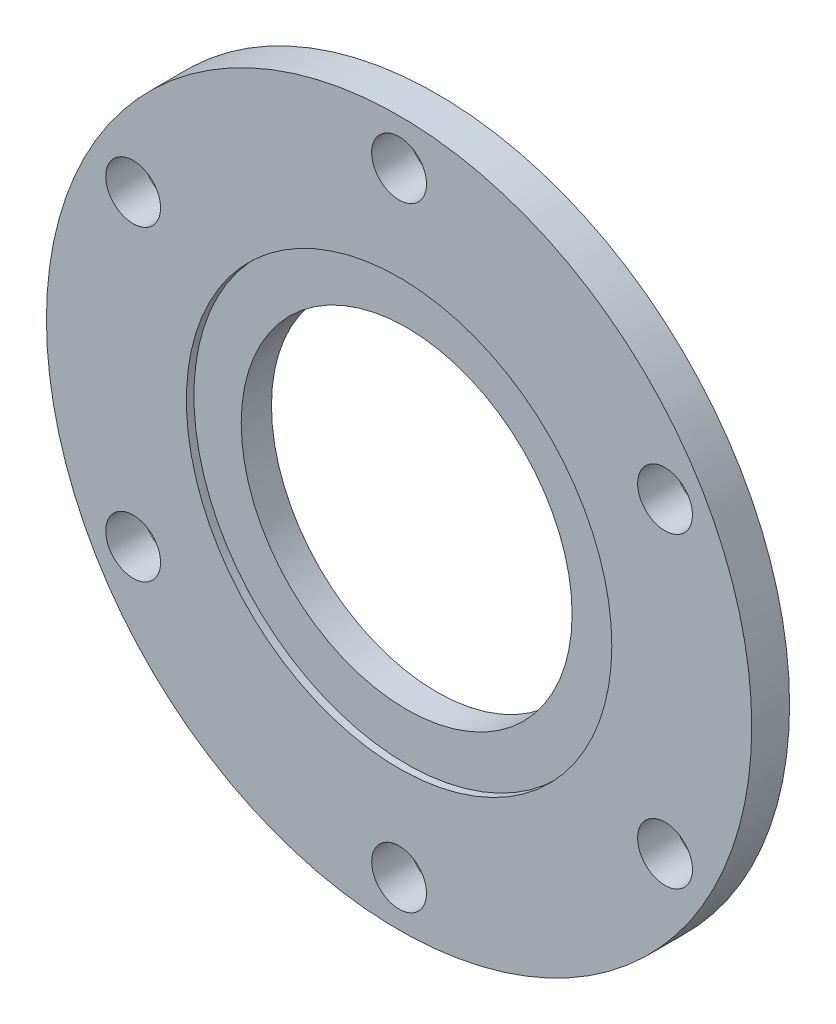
ISO-10303-21;
HEADER;
FILE_DESCRIPTION(('STEP AP214'),'2;1');
FILE_NAME('part.step','',(''),(''),'','','');
FILE_SCHEMA(('AUTOMOTIVE_DESIGN { 1 0 10303 214 1 1 1 1 }'));
ENDSEC;
DATA;
#1=APPLICATION_CONTEXT('core data for automotive mechanical design processes');
#2=APPLICATION_PROTOCOL_DEFINITION('international standard','automotive_design',2000,#1);
#3=PRODUCT_CONTEXT('',#1,'mechanical');
#4=PRODUCT('Part','Part','',(#3));
#5=PRODUCT_RELATED_PRODUCT_CATEGORY('part','',(#4));
#6=PRODUCT_DEFINITION_FORMATION('','',#4);
#7=PRODUCT_DEFINITION_CONTEXT('part definition',#1,'design');
#8=PRODUCT_DEFINITION('design','',#6,#7);
#9=PRODUCT_DEFINITION_SHAPE('','',#8);
#10=(LENGTH_UNIT() NAMED_UNIT(*) SI_UNIT(.MILLI.,.METRE.));
#11=(NAMED_UNIT(*) PLANE_ANGLE_UNIT() SI_UNIT($,.RADIAN.));
#12=(NAMED_UNIT(*) SI_UNIT($,.STERADIAN.) SOLID_ANGLE_UNIT());
#13=UNCERTAINTY_MEASURE_WITH_UNIT(LENGTH_MEASURE(1.E-05),#10,'distance_accuracy_value','');
#14=(GEOMETRIC_REPRESENTATION_CONTEXT(3) GLOBAL_UNCERTAINTY_ASSIGNED_CONTEXT((#13)) GLOBAL_UNIT_ASSIGNED_CONTEXT((#10,
#11,#12)) REPRESENTATION_CONTEXT('',''));
#15=CARTESIAN_POINT('',(0.,0.,0.));
#16=DIRECTION('',(0.,0.,1.));
#17=DIRECTION('',(1.,0.,0.));
#18=AXIS2_PLACEMENT_3D('',#15,#16,#17);
#19=CARTESIAN_POINT('',(0.,0.,2.54));
#20=DIRECTION('',(0.,0.,-1.));
#21=DIRECTION('',(-1.,0.,0.));
#22=AXIS2_PLACEMENT_3D('',#19,#20,#21);
#23=CYLINDRICAL_SURFACE('',#22,11.1125);
#24=CARTESIAN_POINT('',(0.,0.,0.));
#25=DIRECTION('',(0.,0.,1.));
#26=DIRECTION('',(1.,0.,0.));
#27=AXIS2_PLACEMENT_3D('',#24,#25,#26);
#28=CIRCLE('',#27,11.1125);
#29=CARTESIAN_POINT('',(11.1125,0.,0.));
#30=VERTEX_POINT('',#29);
#31=EDGE_CURVE('E44',#30,#30,#28,.T.);
#32=ORIENTED_EDGE('',*,*,#31,.F.);
#33=EDGE_LOOP('',(#32));
#34=FACE_BOUND('',#33,.T.);
#35=CARTESIAN_POINT('',(0.,0.,2.032));
#36=DIRECTION('',(0.,0.,1.));
#37=DIRECTION('',(1.,0.,0.));
#38=AXIS2_PLACEMENT_3D('',#35,#36,#37);
#39=CIRCLE('',#38,11.1125);
#40=CARTESIAN_POINT('',(11.1125,0.,2.032));
#41=VERTEX_POINT('',#40);
#42=EDGE_CURVE('E35',#41,#41,#39,.T.);
#43=ORIENTED_EDGE('',*,*,#42,.T.);
#44=EDGE_LOOP('',(#43));
#45=FACE_BOUND('',#44,.T.);
#46=ADVANCED_FACE('F31',(#34,#45),#23,.F.);
#47=CARTESIAN_POINT('',(0.,0.,2.54));
#48=DIRECTION('',(0.,0.,1.));
#49=DIRECTION('',(1.,0.,0.));
#50=AXIS2_PLACEMENT_3D('',#47,#48,#49);
#51=PLANE('',#50);
#52=CARTESIAN_POINT('',(17.8616007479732,10.3124000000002,2.54));
#53=DIRECTION('',(0.,0.,1.));
#54=DIRECTION('',(0.50000000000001,-0.866025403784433,0.));
#55=AXIS2_PLACEMENT_3D('',#52,#53,#54);
#56=CIRCLE('',#55,1.8415);
#57=CARTESIAN_POINT('',(18.7823507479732,8.71761421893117,2.54));
#58=VERTEX_POINT('',#57);
#59=EDGE_CURVE('E67',#58,#58,#56,.T.);
#60=ORIENTED_EDGE('',*,*,#59,.F.);
#61=EDGE_LOOP('',(#60));
#62=FACE_BOUND('',#61,.T.);
#63=CARTESIAN_POINT('',(17.8616007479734,-10.3123999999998,2.54));
#64=DIRECTION('',(0.,0.,1.));
#65=DIRECTION('',(-0.499999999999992,-0.866025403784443,0.));
#66=AXIS2_PLACEMENT_3D('',#63,#64,#65);
#67=CIRCLE('',#66,1.8415);
#68=CARTESIAN_POINT('',(16.9408507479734,-11.9071857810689,2.54));
#69=VERTEX_POINT('',#68);
#70=EDGE_CURVE('E73',#69,#69,#67,.T.);
#71=ORIENTED_EDGE('',*,*,#70,.F.);
#72=EDGE_LOOP('',(#71));
#73=FACE_BOUND('',#72,.T.);
#74=CARTESIAN_POINT('',(0.,-20.6248,2.54));
#75=DIRECTION('',(0.,0.,1.));
#76=DIRECTION('',(-1.,0.,0.));
#77=AXIS2_PLACEMENT_3D('',#74,#75,#76);
#78=CIRCLE('',#77,1.8415);
#79=CARTESIAN_POINT('',(-1.8415,-20.6248,2.54));
#80=VERTEX_POINT('',#79);
#81=EDGE_CURVE('E79',#80,#80,#78,.T.);
#82=ORIENTED_EDGE('',*,*,#81,.F.);
#83=EDGE_LOOP('',(#82));
#84=FACE_BOUND('',#83,.T.);
#85=CARTESIAN_POINT('',(-17.8616007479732,-10.3124000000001,2.54));
#86=DIRECTION('',(0.,0.,1.));
#87=DIRECTION('',(-0.500000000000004,0.866025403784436,0.));
#88=AXIS2_PLACEMENT_3D('',#85,#86,#87);
#89=CIRCLE('',#88,1.8415);
#90=CARTESIAN_POINT('',(-18.7823507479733,-8.71761421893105,2.54));
#91=VERTEX_POINT('',#90);
#92=EDGE_CURVE('E85',#91,#91,#89,.T.);
#93=ORIENTED_EDGE('',*,*,#92,.F.);
#94=EDGE_LOOP('',(#93));
#95=FACE_BOUND('',#94,.T.);
#96=CARTESIAN_POINT('',(-17.8616007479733,10.3124,2.54));
#97=DIRECTION('',(0.,0.,1.));
#98=DIRECTION('',(0.499999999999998,0.86602540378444,0.));
#99=AXIS2_PLACEMENT_3D('',#96,#97,#98);
#100=CIRCLE('',#99,1.8415);
#101=CARTESIAN_POINT('',(-16.9408507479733,11.907185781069,2.54));
#102=VERTEX_POINT('',#101);
#103=EDGE_CURVE('E61',#102,#102,#100,.T.);
#104=ORIENTED_EDGE('',*,*,#103,.F.);
#105=EDGE_LOOP('',(#104));
#106=FACE_BOUND('',#105,.T.);
#107=CARTESIAN_POINT('',(0.,20.6248,2.54));
#108=DIRECTION('',(0.,0.,1.));
#109=DIRECTION('',(1.,0.,0.));
#110=AXIS2_PLACEMENT_3D('',#107,#108,#109);
#111=CIRCLE('',#110,1.8415);
#112=CARTESIAN_POINT('',(1.8415,20.6248,2.54));
#113=VERTEX_POINT('',#112);
#114=EDGE_CURVE('E55',#113,#113,#111,.T.);
#115=ORIENTED_EDGE('',*,*,#114,.F.);
#116=EDGE_LOOP('',(#115));
#117=FACE_BOUND('',#116,.T.);
#118=CARTESIAN_POINT('',(0.,0.,2.54));
#119=DIRECTION('',(0.,0.,1.));
#120=DIRECTION('',(1.,0.,0.));
#121=AXIS2_PLACEMENT_3D('',#118,#119,#120);
#122=CIRCLE('',#121,14.2875);
#123=CARTESIAN_POINT('',(14.2875,0.,2.54));
#124=VERTEX_POINT('',#123);
#125=EDGE_CURVE('E48',#124,#124,#122,.T.);
#126=ORIENTED_EDGE('',*,*,#125,.F.);
#127=EDGE_LOOP('',(#126));
#128=FACE_BOUND('',#127,.T.);
#129=CARTESIAN_POINT('',(0.,0.,2.54));
#130=DIRECTION('',(0.,0.,1.));
#131=DIRECTION('',(1.,0.,0.));
#132=AXIS2_PLACEMENT_3D('',#129,#130,#131);
#133=CIRCLE('',#132,23.6855);
#134=CARTESIAN_POINT('',(23.6855,0.,2.54));
#135=VERTEX_POINT('',#134);
#136=EDGE_CURVE('E10',#135,#135,#133,.T.);
#137=ORIENTED_EDGE('',*,*,#136,.T.);
#138=EDGE_LOOP('',(#137));
#139=FACE_BOUND('',#138,.T.);
#140=ADVANCED_FACE('F102',(#62,#73,#84,#95,#106,#117,#128,#139),#51,.T.);
#141=CARTESIAN_POINT('',(0.,0.,0.));
#142=DIRECTION('',(0.,0.,1.));
#143=DIRECTION('',(1.,0.,0.));
#144=AXIS2_PLACEMENT_3D('',#141,#142,#143);
#145=PLANE('',#144);
#146=CARTESIAN_POINT('',(17.8616007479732,10.3124000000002,0.));
#147=DIRECTION('',(0.,0.,1.));
#148=DIRECTION('',(0.50000000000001,-0.866025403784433,0.));
#149=AXIS2_PLACEMENT_3D('',#146,#147,#148);
#150=CIRCLE('',#149,1.8415);
#151=CARTESIAN_POINT('',(18.7823507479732,8.71761421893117,0.));
#152=VERTEX_POINT('',#151);
#153=EDGE_CURVE('E70',#152,#152,#150,.T.);
#154=ORIENTED_EDGE('',*,*,#153,.T.);
#155=EDGE_LOOP('',(#154));
#156=FACE_BOUND('',#155,.T.);
#157=CARTESIAN_POINT('',(17.8616007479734,-10.3123999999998,0.));
#158=DIRECTION('',(0.,0.,1.));
#159=DIRECTION('',(-0.499999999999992,-0.866025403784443,0.));
#160=AXIS2_PLACEMENT_3D('',#157,#158,#159);
#161=CIRCLE('',#160,1.8415);
#162=CARTESIAN_POINT('',(16.9408507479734,-11.9071857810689,0.));
#163=VERTEX_POINT('',#162);
#164=EDGE_CURVE('E76',#163,#163,#161,.T.);
#165=ORIENTED_EDGE('',*,*,#164,.T.);
#166=EDGE_LOOP('',(#165));
#167=FACE_BOUND('',#166,.T.);
#168=CARTESIAN_POINT('',(0.,-20.6248,0.));
#169=DIRECTION('',(0.,0.,1.));
#170=DIRECTION('',(-1.,0.,0.));
#171=AXIS2_PLACEMENT_3D('',#168,#169,#170);
#172=CIRCLE('',#171,1.8415);
#173=CARTESIAN_POINT('',(-1.8415,-20.6248,0.));
#174=VERTEX_POINT('',#173);
#175=EDGE_CURVE('E82',#174,#174,#172,.T.);
#176=ORIENTED_EDGE('',*,*,#175,.T.);
#177=EDGE_LOOP('',(#176));
#178=FACE_BOUND('',#177,.T.);
#179=CARTESIAN_POINT('',(-17.8616007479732,-10.3124000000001,0.));
#180=DIRECTION('',(0.,0.,1.));
#181=DIRECTION('',(-0.500000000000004,0.866025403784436,0.));
#182=AXIS2_PLACEMENT_3D('',#179,#180,#181);
#183=CIRCLE('',#182,1.8415);
#184=CARTESIAN_POINT('',(-18.7823507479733,-8.71761421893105,0.));
#185=VERTEX_POINT('',#184);
#186=EDGE_CURVE('E64',#185,#185,#183,.T.);
#187=ORIENTED_EDGE('',*,*,#186,.T.);
#188=EDGE_LOOP('',(#187));
#189=FACE_BOUND('',#188,.T.);
#190=CARTESIAN_POINT('',(-17.8616007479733,10.3124,0.));
#191=DIRECTION('',(0.,0.,1.));
#192=DIRECTION('',(0.499999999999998,0.86602540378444,0.));
#193=AXIS2_PLACEMENT_3D('',#190,#191,#192);
#194=CIRCLE('',#193,1.8415);
#195=CARTESIAN_POINT('',(-16.9408507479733,11.907185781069,0.));
#196=VERTEX_POINT('',#195);
#197=EDGE_CURVE('E58',#196,#196,#194,.T.);
#198=ORIENTED_EDGE('',*,*,#197,.T.);
#199=EDGE_LOOP('',(#198));
#200=FACE_BOUND('',#199,.T.);
#201=CARTESIAN_POINT('',(0.,20.6248,0.));
#202=DIRECTION('',(0.,0.,1.));
#203=DIRECTION('',(1.,0.,0.));
#204=AXIS2_PLACEMENT_3D('',#201,#202,#203);
#205=CIRCLE('',#204,1.8415);
#206=CARTESIAN_POINT('',(1.8415,20.6248,0.));
#207=VERTEX_POINT('',#206);
#208=EDGE_CURVE('E52',#207,#207,#205,.T.);
#209=ORIENTED_EDGE('',*,*,#208,.T.);
#210=EDGE_LOOP('',(#209));
#211=FACE_BOUND('',#210,.T.);
#212=CARTESIAN_POINT('',(0.,0.,0.));
#213=DIRECTION('',(0.,0.,1.));
#214=DIRECTION('',(1.,0.,0.));
#215=AXIS2_PLACEMENT_3D('',#212,#213,#214);
#216=CIRCLE('',#215,23.6855);
#217=CARTESIAN_POINT('',(23.6855,0.,0.));
#218=VERTEX_POINT('',#217);
#219=EDGE_CURVE('E39',#218,#218,#216,.T.);
#220=ORIENTED_EDGE('',*,*,#219,.F.);
#221=EDGE_LOOP('',(#220));
#222=FACE_BOUND('',#221,.T.);
#223=ORIENTED_EDGE('',*,*,#31,.T.);
#224=EDGE_LOOP('',(#223));
#225=FACE_BOUND('',#224,.T.);
#226=ADVANCED_FACE('F91',(#156,#167,#178,#189,#200,#211,#222,#225),#145,.F.);
#227=CARTESIAN_POINT('',(0.,0.,2.54));
#228=DIRECTION('',(0.,0.,-1.));
#229=DIRECTION('',(-1.,0.,0.));
#230=AXIS2_PLACEMENT_3D('',#227,#228,#229);
#231=CYLINDRICAL_SURFACE('',#230,23.6855);
#232=ORIENTED_EDGE('',*,*,#136,.F.);
#233=EDGE_LOOP('',(#232));
#234=FACE_BOUND('',#233,.T.);
#235=ORIENTED_EDGE('',*,*,#219,.T.);
#236=EDGE_LOOP('',(#235));
#237=FACE_BOUND('',#236,.T.);
#238=ADVANCED_FACE('F33',(#234,#237),#231,.T.);
#239=CARTESIAN_POINT('',(0.,0.,2.032));
#240=DIRECTION('',(0.,0.,1.));
#241=DIRECTION('',(1.,0.,0.));
#242=AXIS2_PLACEMENT_3D('',#239,#240,#241);
#243=CYLINDRICAL_SURFACE('',#242,14.2875);
#244=CARTESIAN_POINT('',(0.,0.,2.032));
#245=DIRECTION('',(0.,0.,1.));
#246=DIRECTION('',(1.,0.,0.));
#247=AXIS2_PLACEMENT_3D('',#244,#245,#246);
#248=CIRCLE('',#247,14.2875);
#249=CARTESIAN_POINT('',(14.2875,0.,2.032));
#250=VERTEX_POINT('',#249);
#251=EDGE_CURVE('E51',#250,#250,#248,.T.);
#252=ORIENTED_EDGE('',*,*,#251,.F.);
#253=EDGE_LOOP('',(#252));
#254=FACE_BOUND('',#253,.T.);
#255=ORIENTED_EDGE('',*,*,#125,.T.);
#256=EDGE_LOOP('',(#255));
#257=FACE_BOUND('',#256,.T.);
#258=ADVANCED_FACE('F113',(#254,#257),#243,.F.);
#259=CARTESIAN_POINT('',(0.,0.,2.032));
#260=DIRECTION('',(0.,0.,1.));
#261=DIRECTION('',(1.,0.,0.));
#262=AXIS2_PLACEMENT_3D('',#259,#260,#261);
#263=PLANE('',#262);
#264=ORIENTED_EDGE('',*,*,#42,.F.);
#265=EDGE_LOOP('',(#264));
#266=FACE_BOUND('',#265,.T.);
#267=ORIENTED_EDGE('',*,*,#251,.T.);
#268=EDGE_LOOP('',(#267));
#269=FACE_BOUND('',#268,.T.);
#270=ADVANCED_FACE('F115',(#266,#269),#263,.T.);
#271=CARTESIAN_POINT('',(0.,20.6248,0.));
#272=DIRECTION('',(0.,0.,1.));
#273=DIRECTION('',(1.,0.,0.));
#274=AXIS2_PLACEMENT_3D('',#271,#272,#273);
#275=CYLINDRICAL_SURFACE('',#274,1.8415);
#276=ORIENTED_EDGE('',*,*,#208,.F.);
#277=EDGE_LOOP('',(#276));
#278=FACE_BOUND('',#277,.T.);
#279=ORIENTED_EDGE('',*,*,#114,.T.);
#280=EDGE_LOOP('',(#279));
#281=FACE_BOUND('',#280,.T.);
#282=ADVANCED_FACE('F122',(#278,#281),#275,.F.);
#283=CARTESIAN_POINT('',(-17.8616007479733,10.3124,0.));
#284=DIRECTION('',(0.,0.,1.));
#285=DIRECTION('',(1.,0.,0.));
#286=AXIS2_PLACEMENT_3D('',#283,#284,#285);
#287=CYLINDRICAL_SURFACE('',#286,1.8415);
#288=ORIENTED_EDGE('',*,*,#197,.F.);
#289=EDGE_LOOP('',(#288));
#290=FACE_BOUND('',#289,.T.);
#291=ORIENTED_EDGE('',*,*,#103,.T.);
#292=EDGE_LOOP('',(#291));
#293=FACE_BOUND('',#292,.T.);
#294=ADVANCED_FACE('F98',(#290,#293),#287,.F.);
#295=CARTESIAN_POINT('',(-17.8616007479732,-10.3124000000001,0.));
#296=DIRECTION('',(0.,0.,1.));
#297=DIRECTION('',(1.,0.,0.));
#298=AXIS2_PLACEMENT_3D('',#295,#296,#297);
#299=CYLINDRICAL_SURFACE('',#298,1.8415);
#300=ORIENTED_EDGE('',*,*,#186,.F.);
#301=EDGE_LOOP('',(#300));
#302=FACE_BOUND('',#301,.T.);
#303=ORIENTED_EDGE('',*,*,#92,.T.);
#304=EDGE_LOOP('',(#303));
#305=FACE_BOUND('',#304,.T.);
#306=ADVANCED_FACE('F94',(#302,#305),#299,.F.);
#307=CARTESIAN_POINT('',(0.,-20.6248,0.));
#308=DIRECTION('',(0.,0.,1.));
#309=DIRECTION('',(1.,0.,0.));
#310=AXIS2_PLACEMENT_3D('',#307,#308,#309);
#311=CYLINDRICAL_SURFACE('',#310,1.8415);
#312=ORIENTED_EDGE('',*,*,#175,.F.);
#313=EDGE_LOOP('',(#312));
#314=FACE_BOUND('',#313,.T.);
#315=ORIENTED_EDGE('',*,*,#81,.T.);
#316=EDGE_LOOP('',(#315));
#317=FACE_BOUND('',#316,.T.);
#318=ADVANCED_FACE('F97',(#314,#317),#311,.F.);
#319=CARTESIAN_POINT('',(17.8616007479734,-10.3123999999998,0.));
#320=DIRECTION('',(0.,0.,1.));
#321=DIRECTION('',(1.,0.,0.));
#322=AXIS2_PLACEMENT_3D('',#319,#320,#321);
#323=CYLINDRICAL_SURFACE('',#322,1.8415);
#324=ORIENTED_EDGE('',*,*,#164,.F.);
#325=EDGE_LOOP('',(#324));
#326=FACE_BOUND('',#325,.T.);
#327=ORIENTED_EDGE('',*,*,#70,.T.);
#328=EDGE_LOOP('',(#327));
#329=FACE_BOUND('',#328,.T.);
#330=ADVANCED_FACE('F146',(#326,#329),#323,.F.);
#331=CARTESIAN_POINT('',(17.8616007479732,10.3124000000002,0.));
#332=DIRECTION('',(0.,0.,1.));
#333=DIRECTION('',(1.,0.,0.));
#334=AXIS2_PLACEMENT_3D('',#331,#332,#333);
#335=CYLINDRICAL_SURFACE('',#334,1.8415);
#336=ORIENTED_EDGE('',*,*,#153,.F.);
#337=EDGE_LOOP('',(#336));
#338=FACE_BOUND('',#337,.T.);
#339=ORIENTED_EDGE('',*,*,#59,.T.);
#340=EDGE_LOOP('',(#339));
#341=FACE_BOUND('',#340,.T.);
#342=ADVANCED_FACE('F153',(#338,#341),#335,.F.);
#343=CLOSED_SHELL('',(#46,#140,#226,#238,#258,#270,#282,#294,#306,#318,#330,#342));
#344=MANIFOLD_SOLID_BREP('B2',#343);
#345=ADVANCED_BREP_SHAPE_REPRESENTATION('',(#18,#344),#14);
#346=SHAPE_DEFINITION_REPRESENTATION(#9,#345);
ENDSEC;
END-ISO-10303-21;
